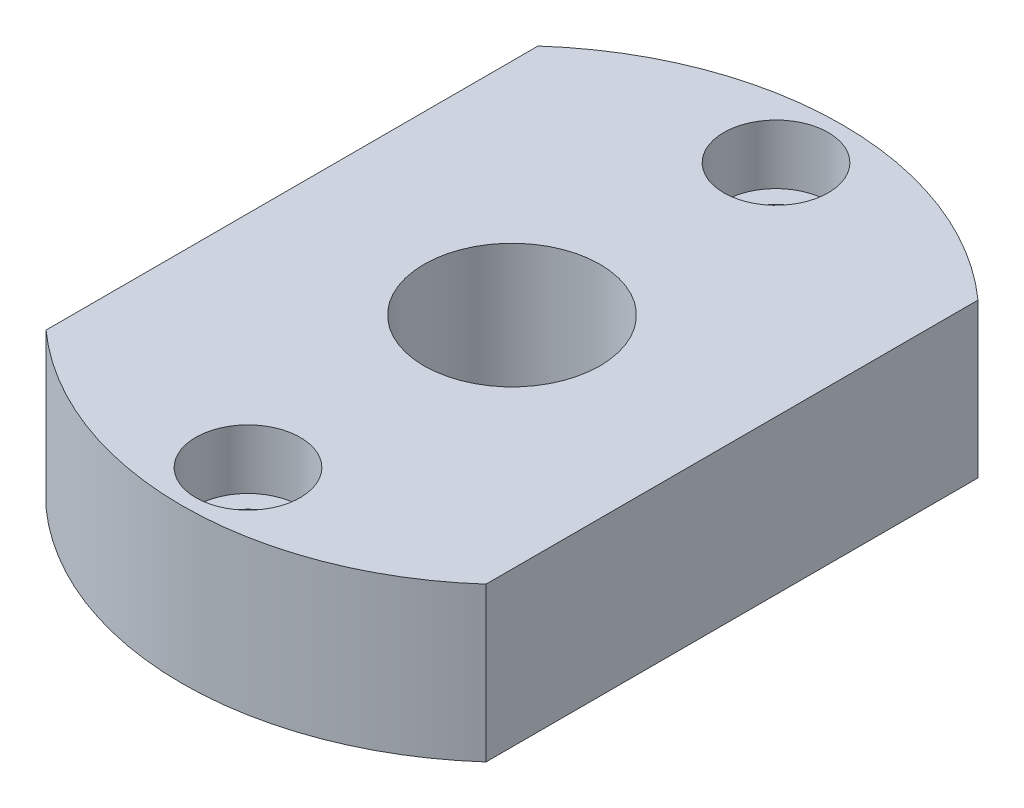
ISO-10303-21;
HEADER;
FILE_DESCRIPTION(('STEP AP214'),'2;1');
FILE_NAME('part.step','',(''),(''),'','','');
FILE_SCHEMA(('AUTOMOTIVE_DESIGN { 1 0 10303 214 1 1 1 1 }'));
ENDSEC;
DATA;
#1=APPLICATION_CONTEXT('core data for automotive mechanical design processes');
#2=APPLICATION_PROTOCOL_DEFINITION('international standard','automotive_design',2000,#1);
#3=PRODUCT_CONTEXT('',#1,'mechanical');
#4=PRODUCT('Part','Part','',(#3));
#5=PRODUCT_RELATED_PRODUCT_CATEGORY('part','',(#4));
#6=PRODUCT_DEFINITION_FORMATION('','',#4);
#7=PRODUCT_DEFINITION_CONTEXT('part definition',#1,'design');
#8=PRODUCT_DEFINITION('design','',#6,#7);
#9=PRODUCT_DEFINITION_SHAPE('','',#8);
#10=(LENGTH_UNIT() NAMED_UNIT(*) SI_UNIT(.MILLI.,.METRE.));
#11=(NAMED_UNIT(*) PLANE_ANGLE_UNIT() SI_UNIT($,.RADIAN.));
#12=(NAMED_UNIT(*) SI_UNIT($,.STERADIAN.) SOLID_ANGLE_UNIT());
#13=UNCERTAINTY_MEASURE_WITH_UNIT(LENGTH_MEASURE(1.E-05),#10,'distance_accuracy_value','');
#14=(GEOMETRIC_REPRESENTATION_CONTEXT(3) GLOBAL_UNCERTAINTY_ASSIGNED_CONTEXT((#13)) GLOBAL_UNIT_ASSIGNED_CONTEXT((#10,
#11,#12)) REPRESENTATION_CONTEXT('',''));
#15=CARTESIAN_POINT('',(0.,0.,0.));
#16=DIRECTION('',(0.,0.,1.));
#17=DIRECTION('',(1.,0.,0.));
#18=AXIS2_PLACEMENT_3D('',#15,#16,#17);
#19=CARTESIAN_POINT('',(0.,14.,0.));
#20=DIRECTION('',(0.,-1.,0.));
#21=DIRECTION('',(0.,0.,-1.));
#22=AXIS2_PLACEMENT_3D('',#19,#20,#21);
#23=CYLINDRICAL_SURFACE('',#22,30.);
#24=DIRECTION('',(0.,-1.,0.));
#25=VECTOR('',#24,1.);
#26=CARTESIAN_POINT('',(20.,14.,22.3606797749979));
#27=LINE('',#26,#25);
#28=CARTESIAN_POINT('',(20.,14.,22.3606797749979));
#29=VERTEX_POINT('',#28);
#30=CARTESIAN_POINT('',(20.,0.,22.3606797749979));
#31=VERTEX_POINT('',#30);
#32=EDGE_CURVE('E130',#29,#31,#27,.T.);
#33=ORIENTED_EDGE('',*,*,#32,.F.);
#34=CARTESIAN_POINT('',(0.,14.,0.));
#35=DIRECTION('',(0.,1.,0.));
#36=DIRECTION('',(0.,0.,1.));
#37=AXIS2_PLACEMENT_3D('',#34,#35,#36);
#38=CIRCLE('',#37,30.);
#39=CARTESIAN_POINT('',(-20.,14.,22.3606797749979));
#40=VERTEX_POINT('',#39);
#41=EDGE_CURVE('E103',#40,#29,#38,.T.);
#42=ORIENTED_EDGE('',*,*,#41,.F.);
#43=DIRECTION('',(0.,-1.,0.));
#44=VECTOR('',#43,1.);
#45=CARTESIAN_POINT('',(-20.,14.,22.3606797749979));
#46=LINE('',#45,#44);
#47=CARTESIAN_POINT('',(-20.,0.,22.3606797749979));
#48=VERTEX_POINT('',#47);
#49=EDGE_CURVE('E84',#48,#40,#46,.F.);
#50=ORIENTED_EDGE('',*,*,#49,.F.);
#51=CARTESIAN_POINT('',(0.,0.,0.));
#52=DIRECTION('',(0.,1.,0.));
#53=DIRECTION('',(0.,0.,1.));
#54=AXIS2_PLACEMENT_3D('',#51,#52,#53);
#55=CIRCLE('',#54,30.);
#56=EDGE_CURVE('E108',#48,#31,#55,.T.);
#57=ORIENTED_EDGE('',*,*,#56,.T.);
#58=EDGE_LOOP('',(#33,#42,#50,#57));
#59=FACE_BOUND('',#58,.T.);
#60=ADVANCED_FACE('F45',(#59),#23,.T.);
#61=DIRECTION('',(0.,-1.,0.));
#62=VECTOR('',#61,1.);
#63=CARTESIAN_POINT('',(20.,14.,-22.3606797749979));
#64=LINE('',#63,#62);
#65=CARTESIAN_POINT('',(20.,0.,-22.3606797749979));
#66=VERTEX_POINT('',#65);
#67=CARTESIAN_POINT('',(20.,14.,-22.3606797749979));
#68=VERTEX_POINT('',#67);
#69=EDGE_CURVE('E97',#66,#68,#64,.F.);
#70=ORIENTED_EDGE('',*,*,#69,.F.);
#71=CARTESIAN_POINT('',(-20.,0.,-22.3606797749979));
#72=VERTEX_POINT('',#71);
#73=EDGE_CURVE('E98',#66,#72,#55,.T.);
#74=ORIENTED_EDGE('',*,*,#73,.T.);
#75=DIRECTION('',(0.,-1.,0.));
#76=VECTOR('',#75,1.);
#77=CARTESIAN_POINT('',(-20.,14.,-22.3606797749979));
#78=LINE('',#77,#76);
#79=CARTESIAN_POINT('',(-20.,14.,-22.3606797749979));
#80=VERTEX_POINT('',#79);
#81=EDGE_CURVE('E85',#80,#72,#78,.T.);
#82=ORIENTED_EDGE('',*,*,#81,.F.);
#83=EDGE_CURVE('E93',#68,#80,#38,.T.);
#84=ORIENTED_EDGE('',*,*,#83,.F.);
#85=EDGE_LOOP('',(#70,#74,#82,#84));
#86=FACE_BOUND('',#85,.T.);
#87=ADVANCED_FACE('F94',(#86),#23,.T.);
#88=CARTESIAN_POINT('',(0.,14.,0.));
#89=DIRECTION('',(0.,1.,0.));
#90=DIRECTION('',(0.,0.,1.));
#91=AXIS2_PLACEMENT_3D('',#88,#89,#90);
#92=PLANE('',#91);
#93=CARTESIAN_POINT('',(0.,14.,-24.));
#94=DIRECTION('',(0.,1.,0.));
#95=DIRECTION('',(0.,0.,1.));
#96=AXIS2_PLACEMENT_3D('',#93,#94,#95);
#97=CIRCLE('',#96,4.75);
#98=CARTESIAN_POINT('',(0.,14.,-19.25));
#99=VERTEX_POINT('',#98);
#100=EDGE_CURVE('E118',#99,#99,#97,.T.);
#101=ORIENTED_EDGE('',*,*,#100,.F.);
#102=EDGE_LOOP('',(#101));
#103=FACE_BOUND('',#102,.T.);
#104=CARTESIAN_POINT('',(0.,14.,24.));
#105=DIRECTION('',(0.,1.,0.));
#106=DIRECTION('',(0.,0.,1.));
#107=AXIS2_PLACEMENT_3D('',#104,#105,#106);
#108=CIRCLE('',#107,4.75);
#109=CARTESIAN_POINT('',(0.,14.,28.75));
#110=VERTEX_POINT('',#109);
#111=EDGE_CURVE('E121',#110,#110,#108,.T.);
#112=ORIENTED_EDGE('',*,*,#111,.F.);
#113=EDGE_LOOP('',(#112));
#114=FACE_BOUND('',#113,.T.);
#115=CARTESIAN_POINT('',(0.,14.,0.));
#116=DIRECTION('',(0.,1.,0.));
#117=DIRECTION('',(0.,0.,1.));
#118=AXIS2_PLACEMENT_3D('',#115,#116,#117);
#119=CIRCLE('',#118,8.);
#120=CARTESIAN_POINT('',(0.,14.,8.));
#121=VERTEX_POINT('',#120);
#122=EDGE_CURVE('E106',#121,#121,#119,.T.);
#123=ORIENTED_EDGE('',*,*,#122,.F.);
#124=EDGE_LOOP('',(#123));
#125=FACE_BOUND('',#124,.T.);
#126=ORIENTED_EDGE('',*,*,#41,.T.);
#127=DIRECTION('',(0.,0.,-1.));
#128=VECTOR('',#127,1.);
#129=CARTESIAN_POINT('',(20.,14.,32.5));
#130=LINE('',#129,#128);
#131=EDGE_CURVE('E88',#29,#68,#130,.T.);
#132=ORIENTED_EDGE('',*,*,#131,.T.);
#133=ORIENTED_EDGE('',*,*,#83,.T.);
#134=DIRECTION('',(0.,0.,1.));
#135=VECTOR('',#134,1.);
#136=CARTESIAN_POINT('',(-20.,14.,32.5));
#137=LINE('',#136,#135);
#138=EDGE_CURVE('E79',#80,#40,#137,.T.);
#139=ORIENTED_EDGE('',*,*,#138,.T.);
#140=EDGE_LOOP('',(#126,#132,#133,#139));
#141=FACE_BOUND('',#140,.T.);
#142=ADVANCED_FACE('F99',(#103,#114,#125,#141),#92,.T.);
#143=CARTESIAN_POINT('',(0.,0.,0.));
#144=DIRECTION('',(0.,1.,0.));
#145=DIRECTION('',(0.,0.,1.));
#146=AXIS2_PLACEMENT_3D('',#143,#144,#145);
#147=PLANE('',#146);
#148=CARTESIAN_POINT('',(0.,0.,-24.));
#149=DIRECTION('',(0.,1.,0.));
#150=DIRECTION('',(0.,0.,1.));
#151=AXIS2_PLACEMENT_3D('',#148,#149,#150);
#152=CIRCLE('',#151,3.);
#153=CARTESIAN_POINT('',(0.,0.,-21.));
#154=VERTEX_POINT('',#153);
#155=EDGE_CURVE('E131',#154,#154,#152,.T.);
#156=ORIENTED_EDGE('',*,*,#155,.T.);
#157=EDGE_LOOP('',(#156));
#158=FACE_BOUND('',#157,.T.);
#159=CARTESIAN_POINT('',(0.,0.,24.));
#160=DIRECTION('',(0.,1.,0.));
#161=DIRECTION('',(0.,0.,-1.));
#162=AXIS2_PLACEMENT_3D('',#159,#160,#161);
#163=CIRCLE('',#162,3.);
#164=CARTESIAN_POINT('',(0.,0.,21.));
#165=VERTEX_POINT('',#164);
#166=EDGE_CURVE('E120',#165,#165,#163,.T.);
#167=ORIENTED_EDGE('',*,*,#166,.T.);
#168=EDGE_LOOP('',(#167));
#169=FACE_BOUND('',#168,.T.);
#170=CARTESIAN_POINT('',(0.,0.,0.));
#171=DIRECTION('',(0.,1.,0.));
#172=DIRECTION('',(0.,0.,1.));
#173=AXIS2_PLACEMENT_3D('',#170,#171,#172);
#174=CIRCLE('',#173,8.);
#175=CARTESIAN_POINT('',(0.,0.,8.));
#176=VERTEX_POINT('',#175);
#177=EDGE_CURVE('E109',#176,#176,#174,.T.);
#178=ORIENTED_EDGE('',*,*,#177,.T.);
#179=EDGE_LOOP('',(#178));
#180=FACE_BOUND('',#179,.T.);
#181=DIRECTION('',(0.,0.,-1.));
#182=VECTOR('',#181,1.);
#183=CARTESIAN_POINT('',(20.,0.,32.5));
#184=LINE('',#183,#182);
#185=EDGE_CURVE('E12',#31,#66,#184,.T.);
#186=ORIENTED_EDGE('',*,*,#185,.F.);
#187=ORIENTED_EDGE('',*,*,#56,.F.);
#188=DIRECTION('',(0.,0.,1.));
#189=VECTOR('',#188,1.);
#190=CARTESIAN_POINT('',(-20.,0.,32.5));
#191=LINE('',#190,#189);
#192=EDGE_CURVE('E49',#72,#48,#191,.T.);
#193=ORIENTED_EDGE('',*,*,#192,.F.);
#194=ORIENTED_EDGE('',*,*,#73,.F.);
#195=EDGE_LOOP('',(#186,#187,#193,#194));
#196=FACE_BOUND('',#195,.T.);
#197=ADVANCED_FACE('F149',(#158,#169,#180,#196),#147,.F.);
#198=CARTESIAN_POINT('',(0.,0.,24.));
#199=DIRECTION('',(0.,1.,0.));
#200=DIRECTION('',(0.,0.,1.));
#201=AXIS2_PLACEMENT_3D('',#198,#199,#200);
#202=CYLINDRICAL_SURFACE('',#201,3.);
#203=ORIENTED_EDGE('',*,*,#166,.F.);
#204=EDGE_LOOP('',(#203));
#205=FACE_BOUND('',#204,.T.);
#206=CARTESIAN_POINT('',(0.,8.6,24.));
#207=DIRECTION('',(0.,1.,0.));
#208=DIRECTION('',(0.,0.,1.));
#209=AXIS2_PLACEMENT_3D('',#206,#207,#208);
#210=CIRCLE('',#209,3.);
#211=CARTESIAN_POINT('',(0.,8.6,27.));
#212=VERTEX_POINT('',#211);
#213=EDGE_CURVE('E44',#212,#212,#210,.F.);
#214=ORIENTED_EDGE('',*,*,#213,.F.);
#215=EDGE_LOOP('',(#214));
#216=FACE_BOUND('',#215,.T.);
#217=ADVANCED_FACE('F151',(#205,#216),#202,.F.);
#218=CARTESIAN_POINT('',(0.,0.,-24.));
#219=DIRECTION('',(0.,1.,0.));
#220=DIRECTION('',(0.,0.,1.));
#221=AXIS2_PLACEMENT_3D('',#218,#219,#220);
#222=CYLINDRICAL_SURFACE('',#221,3.);
#223=ORIENTED_EDGE('',*,*,#155,.F.);
#224=EDGE_LOOP('',(#223));
#225=FACE_BOUND('',#224,.T.);
#226=CARTESIAN_POINT('',(0.,8.6,-24.));
#227=DIRECTION('',(0.,1.,0.));
#228=DIRECTION('',(0.,0.,1.));
#229=AXIS2_PLACEMENT_3D('',#226,#227,#228);
#230=CIRCLE('',#229,3.);
#231=CARTESIAN_POINT('',(0.,8.6,-21.));
#232=VERTEX_POINT('',#231);
#233=EDGE_CURVE('E111',#232,#232,#230,.F.);
#234=ORIENTED_EDGE('',*,*,#233,.F.);
#235=EDGE_LOOP('',(#234));
#236=FACE_BOUND('',#235,.T.);
#237=ADVANCED_FACE('F195',(#225,#236),#222,.F.);
#238=CARTESIAN_POINT('',(0.,0.,0.));
#239=DIRECTION('',(0.,1.,0.));
#240=DIRECTION('',(0.,0.,1.));
#241=AXIS2_PLACEMENT_3D('',#238,#239,#240);
#242=CYLINDRICAL_SURFACE('',#241,8.);
#243=ORIENTED_EDGE('',*,*,#177,.F.);
#244=EDGE_LOOP('',(#243));
#245=FACE_BOUND('',#244,.T.);
#246=ORIENTED_EDGE('',*,*,#122,.T.);
#247=EDGE_LOOP('',(#246));
#248=FACE_BOUND('',#247,.T.);
#249=ADVANCED_FACE('F143',(#245,#248),#242,.F.);
#250=CARTESIAN_POINT('',(0.,8.6,-24.));
#251=DIRECTION('',(0.,1.,0.));
#252=DIRECTION('',(0.,0.,1.));
#253=AXIS2_PLACEMENT_3D('',#250,#251,#252);
#254=PLANE('',#253);
#255=CARTESIAN_POINT('',(0.,8.6,-24.));
#256=DIRECTION('',(0.,1.,0.));
#257=DIRECTION('',(0.,0.,1.));
#258=AXIS2_PLACEMENT_3D('',#255,#256,#257);
#259=CIRCLE('',#258,4.75);
#260=CARTESIAN_POINT('',(0.,8.6,-19.25));
#261=VERTEX_POINT('',#260);
#262=EDGE_CURVE('E113',#261,#261,#259,.T.);
#263=ORIENTED_EDGE('',*,*,#262,.T.);
#264=EDGE_LOOP('',(#263));
#265=FACE_BOUND('',#264,.T.);
#266=ORIENTED_EDGE('',*,*,#233,.T.);
#267=EDGE_LOOP('',(#266));
#268=FACE_BOUND('',#267,.T.);
#269=ADVANCED_FACE('F177',(#265,#268),#254,.T.);
#270=CARTESIAN_POINT('',(0.,8.6,-24.));
#271=DIRECTION('',(0.,1.,0.));
#272=DIRECTION('',(0.,0.,1.));
#273=AXIS2_PLACEMENT_3D('',#270,#271,#272);
#274=CYLINDRICAL_SURFACE('',#273,4.75);
#275=CARTESIAN_POINT('',(0.,8.6,-19.25));
#276=CARTESIAN_POINT('',(0.,8.65625,-19.25));
#277=CARTESIAN_POINT('',(0.,8.7125,-19.25));
#278=CARTESIAN_POINT('',(0.,8.825,-19.25));
#279=CARTESIAN_POINT('',(0.,8.88125,-19.25));
#280=CARTESIAN_POINT('',(0.,8.99375,-19.25));
#281=CARTESIAN_POINT('',(0.,9.05,-19.25));
#282=CARTESIAN_POINT('',(0.,9.1625,-19.25));
#283=CARTESIAN_POINT('',(0.,9.21875,-19.25));
#284=CARTESIAN_POINT('',(0.,9.33125,-19.25));
#285=CARTESIAN_POINT('',(0.,9.3875,-19.25));
#286=CARTESIAN_POINT('',(0.,9.5,-19.25));
#287=CARTESIAN_POINT('',(0.,9.55625,-19.25));
#288=CARTESIAN_POINT('',(0.,9.66875,-19.25));
#289=CARTESIAN_POINT('',(0.,9.725,-19.25));
#290=CARTESIAN_POINT('',(0.,9.8375,-19.25));
#291=CARTESIAN_POINT('',(0.,9.89375,-19.25));
#292=CARTESIAN_POINT('',(0.,10.00625,-19.25));
#293=CARTESIAN_POINT('',(0.,10.0625,-19.25));
#294=CARTESIAN_POINT('',(0.,10.175,-19.25));
#295=CARTESIAN_POINT('',(0.,10.23125,-19.25));
#296=CARTESIAN_POINT('',(0.,10.34375,-19.25));
#297=CARTESIAN_POINT('',(0.,10.4,-19.25));
#298=CARTESIAN_POINT('',(0.,10.5125,-19.25));
#299=CARTESIAN_POINT('',(0.,10.56875,-19.25));
#300=CARTESIAN_POINT('',(0.,10.68125,-19.25));
#301=CARTESIAN_POINT('',(0.,10.7375,-19.25));
#302=CARTESIAN_POINT('',(0.,10.85,-19.25));
#303=CARTESIAN_POINT('',(0.,10.90625,-19.25));
#304=CARTESIAN_POINT('',(0.,11.01875,-19.25));
#305=CARTESIAN_POINT('',(0.,11.075,-19.25));
#306=CARTESIAN_POINT('',(0.,11.1875,-19.25));
#307=CARTESIAN_POINT('',(0.,11.24375,-19.25));
#308=CARTESIAN_POINT('',(0.,11.35625,-19.25));
#309=CARTESIAN_POINT('',(0.,11.4125,-19.25));
#310=CARTESIAN_POINT('',(0.,11.525,-19.25));
#311=CARTESIAN_POINT('',(0.,11.58125,-19.25));
#312=CARTESIAN_POINT('',(0.,11.69375,-19.25));
#313=CARTESIAN_POINT('',(0.,11.75,-19.25));
#314=CARTESIAN_POINT('',(0.,11.8625,-19.25));
#315=CARTESIAN_POINT('',(0.,11.91875,-19.25));
#316=CARTESIAN_POINT('',(0.,12.03125,-19.25));
#317=CARTESIAN_POINT('',(0.,12.0875,-19.25));
#318=CARTESIAN_POINT('',(0.,12.2,-19.25));
#319=CARTESIAN_POINT('',(0.,12.25625,-19.25));
#320=CARTESIAN_POINT('',(0.,12.36875,-19.25));
#321=CARTESIAN_POINT('',(0.,12.425,-19.25));
#322=CARTESIAN_POINT('',(0.,12.5375,-19.25));
#323=CARTESIAN_POINT('',(0.,12.59375,-19.25));
#324=CARTESIAN_POINT('',(0.,12.70625,-19.25));
#325=CARTESIAN_POINT('',(0.,12.7625,-19.25));
#326=CARTESIAN_POINT('',(0.,12.875,-19.25));
#327=CARTESIAN_POINT('',(0.,12.93125,-19.25));
#328=CARTESIAN_POINT('',(0.,13.04375,-19.25));
#329=CARTESIAN_POINT('',(0.,13.1,-19.25));
#330=CARTESIAN_POINT('',(0.,13.2125,-19.25));
#331=CARTESIAN_POINT('',(0.,13.26875,-19.25));
#332=CARTESIAN_POINT('',(0.,13.38125,-19.25));
#333=CARTESIAN_POINT('',(0.,13.4375,-19.25));
#334=CARTESIAN_POINT('',(0.,13.55,-19.25));
#335=CARTESIAN_POINT('',(0.,13.60625,-19.25));
#336=CARTESIAN_POINT('',(0.,13.71875,-19.25));
#337=CARTESIAN_POINT('',(0.,13.775,-19.25));
#338=CARTESIAN_POINT('',(0.,13.8875,-19.25));
#339=CARTESIAN_POINT('',(0.,13.94375,-19.25));
#340=CARTESIAN_POINT('',(0.,14.,-19.25));
#341=B_SPLINE_CURVE_WITH_KNOTS('',3,(#275,#276,#277,#278,#279,#280,#281,#282,#283,#284,#285,
#286,#287,#288,#289,#290,#291,#292,#293,#294,#295,#296,#297,#298,#299,#300,#301,#302,#303,#304,
#305,#306,#307,#308,#309,#310,#311,#312,#313,#314,#315,#316,#317,#318,#319,#320,#321,#322,#323,
#324,#325,#326,#327,#328,#329,#330,#331,#332,#333,#334,#335,#336,#337,#338,#339,#340),
.UNSPECIFIED.,.F.,.F.,(4,2,2,2,2,2,2,2,2,2,2,2,2,2,2,2,2,2,2,2,2,2,2,2,2,2,2,2,2,2,2,2,4),(0.,
0.168749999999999,0.337499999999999,0.50625,0.674999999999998,0.843749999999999,1.0125,1.18125,
1.35,1.51875,1.6875,1.85625,2.025,2.19375,2.3625,2.53125,2.7,2.86875,3.0375,3.20625,3.375,
3.54375,3.7125,3.88125,4.05,4.21875,4.3875,4.55625,4.725,4.89375,5.0625,5.23125,5.4),.UNSPECIFIED.);
#342=EDGE_CURVE('BSEAM185',#261,#99,#341,.T.);
#343=ORIENTED_EDGE('',*,*,#262,.F.);
#344=ORIENTED_EDGE('',*,*,#100,.T.);
#345=ORIENTED_EDGE('',*,*,#342,.T.);
#346=ORIENTED_EDGE('',*,*,#342,.F.);
#347=EDGE_LOOP('',(#343,#345,#344,#346));
#348=FACE_BOUND('',#347,.T.);
#349=ADVANCED_FACE('F185',(#348),#274,.F.);
#350=CARTESIAN_POINT('',(0.,8.6,24.));
#351=DIRECTION('',(0.,1.,0.));
#352=DIRECTION('',(0.,0.,1.));
#353=AXIS2_PLACEMENT_3D('',#350,#351,#352);
#354=PLANE('',#353);
#355=CARTESIAN_POINT('',(0.,8.6,24.));
#356=DIRECTION('',(0.,1.,0.));
#357=DIRECTION('',(0.,0.,1.));
#358=AXIS2_PLACEMENT_3D('',#355,#356,#357);
#359=CIRCLE('',#358,4.75);
#360=CARTESIAN_POINT('',(0.,8.6,28.75));
#361=VERTEX_POINT('',#360);
#362=EDGE_CURVE('E135',#361,#361,#359,.T.);
#363=ORIENTED_EDGE('',*,*,#362,.T.);
#364=EDGE_LOOP('',(#363));
#365=FACE_BOUND('',#364,.T.);
#366=ORIENTED_EDGE('',*,*,#213,.T.);
#367=EDGE_LOOP('',(#366));
#368=FACE_BOUND('',#367,.T.);
#369=ADVANCED_FACE('F184',(#365,#368),#354,.T.);
#370=CARTESIAN_POINT('',(0.,8.6,24.));
#371=DIRECTION('',(0.,1.,0.));
#372=DIRECTION('',(0.,0.,1.));
#373=AXIS2_PLACEMENT_3D('',#370,#371,#372);
#374=CYLINDRICAL_SURFACE('',#373,4.75);
#375=CARTESIAN_POINT('',(0.,8.6,28.75));
#376=CARTESIAN_POINT('',(0.,8.65625,28.75));
#377=CARTESIAN_POINT('',(0.,8.7125,28.75));
#378=CARTESIAN_POINT('',(0.,8.825,28.75));
#379=CARTESIAN_POINT('',(0.,8.88125,28.75));
#380=CARTESIAN_POINT('',(0.,8.99375,28.75));
#381=CARTESIAN_POINT('',(0.,9.05,28.75));
#382=CARTESIAN_POINT('',(0.,9.1625,28.75));
#383=CARTESIAN_POINT('',(0.,9.21875,28.75));
#384=CARTESIAN_POINT('',(0.,9.33125,28.75));
#385=CARTESIAN_POINT('',(0.,9.3875,28.75));
#386=CARTESIAN_POINT('',(0.,9.5,28.75));
#387=CARTESIAN_POINT('',(0.,9.55625,28.75));
#388=CARTESIAN_POINT('',(0.,9.66875,28.75));
#389=CARTESIAN_POINT('',(0.,9.725,28.75));
#390=CARTESIAN_POINT('',(0.,9.8375,28.75));
#391=CARTESIAN_POINT('',(0.,9.89375,28.75));
#392=CARTESIAN_POINT('',(0.,10.00625,28.75));
#393=CARTESIAN_POINT('',(0.,10.0625,28.75));
#394=CARTESIAN_POINT('',(0.,10.175,28.75));
#395=CARTESIAN_POINT('',(0.,10.23125,28.75));
#396=CARTESIAN_POINT('',(0.,10.34375,28.75));
#397=CARTESIAN_POINT('',(0.,10.4,28.75));
#398=CARTESIAN_POINT('',(0.,10.5125,28.75));
#399=CARTESIAN_POINT('',(0.,10.56875,28.75));
#400=CARTESIAN_POINT('',(0.,10.68125,28.75));
#401=CARTESIAN_POINT('',(0.,10.7375,28.75));
#402=CARTESIAN_POINT('',(0.,10.85,28.75));
#403=CARTESIAN_POINT('',(0.,10.90625,28.75));
#404=CARTESIAN_POINT('',(0.,11.01875,28.75));
#405=CARTESIAN_POINT('',(0.,11.075,28.75));
#406=CARTESIAN_POINT('',(0.,11.1875,28.75));
#407=CARTESIAN_POINT('',(0.,11.24375,28.75));
#408=CARTESIAN_POINT('',(0.,11.35625,28.75));
#409=CARTESIAN_POINT('',(0.,11.4125,28.75));
#410=CARTESIAN_POINT('',(0.,11.525,28.75));
#411=CARTESIAN_POINT('',(0.,11.58125,28.75));
#412=CARTESIAN_POINT('',(0.,11.69375,28.75));
#413=CARTESIAN_POINT('',(0.,11.75,28.75));
#414=CARTESIAN_POINT('',(0.,11.8625,28.75));
#415=CARTESIAN_POINT('',(0.,11.91875,28.75));
#416=CARTESIAN_POINT('',(0.,12.03125,28.75));
#417=CARTESIAN_POINT('',(0.,12.0875,28.75));
#418=CARTESIAN_POINT('',(0.,12.2,28.75));
#419=CARTESIAN_POINT('',(0.,12.25625,28.75));
#420=CARTESIAN_POINT('',(0.,12.36875,28.75));
#421=CARTESIAN_POINT('',(0.,12.425,28.75));
#422=CARTESIAN_POINT('',(0.,12.5375,28.75));
#423=CARTESIAN_POINT('',(0.,12.59375,28.75));
#424=CARTESIAN_POINT('',(0.,12.70625,28.75));
#425=CARTESIAN_POINT('',(0.,12.7625,28.75));
#426=CARTESIAN_POINT('',(0.,12.875,28.75));
#427=CARTESIAN_POINT('',(0.,12.93125,28.75));
#428=CARTESIAN_POINT('',(0.,13.04375,28.75));
#429=CARTESIAN_POINT('',(0.,13.1,28.75));
#430=CARTESIAN_POINT('',(0.,13.2125,28.75));
#431=CARTESIAN_POINT('',(0.,13.26875,28.75));
#432=CARTESIAN_POINT('',(0.,13.38125,28.75));
#433=CARTESIAN_POINT('',(0.,13.4375,28.75));
#434=CARTESIAN_POINT('',(0.,13.55,28.75));
#435=CARTESIAN_POINT('',(0.,13.60625,28.75));
#436=CARTESIAN_POINT('',(0.,13.71875,28.75));
#437=CARTESIAN_POINT('',(0.,13.775,28.75));
#438=CARTESIAN_POINT('',(0.,13.8875,28.75));
#439=CARTESIAN_POINT('',(0.,13.94375,28.75));
#440=CARTESIAN_POINT('',(0.,14.,28.75));
#441=B_SPLINE_CURVE_WITH_KNOTS('',3,(#375,#376,#377,#378,#379,#380,#381,#382,#383,#384,#385,
#386,#387,#388,#389,#390,#391,#392,#393,#394,#395,#396,#397,#398,#399,#400,#401,#402,#403,#404,
#405,#406,#407,#408,#409,#410,#411,#412,#413,#414,#415,#416,#417,#418,#419,#420,#421,#422,#423,
#424,#425,#426,#427,#428,#429,#430,#431,#432,#433,#434,#435,#436,#437,#438,#439,#440),
.UNSPECIFIED.,.F.,.F.,(4,2,2,2,2,2,2,2,2,2,2,2,2,2,2,2,2,2,2,2,2,2,2,2,2,2,2,2,2,2,2,2,4),(0.,
0.168749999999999,0.337499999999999,0.50625,0.674999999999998,0.843749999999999,1.0125,1.18125,
1.35,1.51875,1.6875,1.85625,2.025,2.19375,2.3625,2.53125,2.7,2.86875,3.0375,3.20625,3.375,
3.54375,3.7125,3.88125,4.05,4.21875,4.3875,4.55625,4.725,4.89375,5.0625,5.23125,5.4),.UNSPECIFIED.);
#442=EDGE_CURVE('BSEAM176',#361,#110,#441,.T.);
#443=ORIENTED_EDGE('',*,*,#362,.F.);
#444=ORIENTED_EDGE('',*,*,#111,.T.);
#445=ORIENTED_EDGE('',*,*,#442,.T.);
#446=ORIENTED_EDGE('',*,*,#442,.F.);
#447=EDGE_LOOP('',(#443,#445,#444,#446));
#448=FACE_BOUND('',#447,.T.);
#449=ADVANCED_FACE('F176',(#448),#374,.F.);
#450=CARTESIAN_POINT('',(-20.,0.,32.5));
#451=DIRECTION('',(-1.,0.,0.));
#452=DIRECTION('',(0.,0.,1.));
#453=AXIS2_PLACEMENT_3D('',#450,#451,#452);
#454=PLANE('',#453);
#455=ORIENTED_EDGE('',*,*,#81,.T.);
#456=ORIENTED_EDGE('',*,*,#192,.T.);
#457=ORIENTED_EDGE('',*,*,#49,.T.);
#458=ORIENTED_EDGE('',*,*,#138,.F.);
#459=EDGE_LOOP('',(#455,#456,#457,#458));
#460=FACE_BOUND('',#459,.T.);
#461=ADVANCED_FACE('F82',(#460),#454,.T.);
#462=CARTESIAN_POINT('',(20.,0.,32.5));
#463=DIRECTION('',(1.,0.,0.));
#464=DIRECTION('',(0.,0.,-1.));
#465=AXIS2_PLACEMENT_3D('',#462,#463,#464);
#466=PLANE('',#465);
#467=ORIENTED_EDGE('',*,*,#32,.T.);
#468=ORIENTED_EDGE('',*,*,#185,.T.);
#469=ORIENTED_EDGE('',*,*,#69,.T.);
#470=ORIENTED_EDGE('',*,*,#131,.F.);
#471=EDGE_LOOP('',(#467,#468,#469,#470));
#472=FACE_BOUND('',#471,.T.);
#473=ADVANCED_FACE('F169',(#472),#466,.T.);
#474=CLOSED_SHELL('',(#60,#87,#142,#197,#217,#237,#249,#269,#349,#369,#449,#461,#473));
#475=MANIFOLD_SOLID_BREP('B2',#474);
#476=ADVANCED_BREP_SHAPE_REPRESENTATION('',(#18,#475),#14);
#477=SHAPE_DEFINITION_REPRESENTATION(#9,#476);
ENDSEC;
END-ISO-10303-21;
